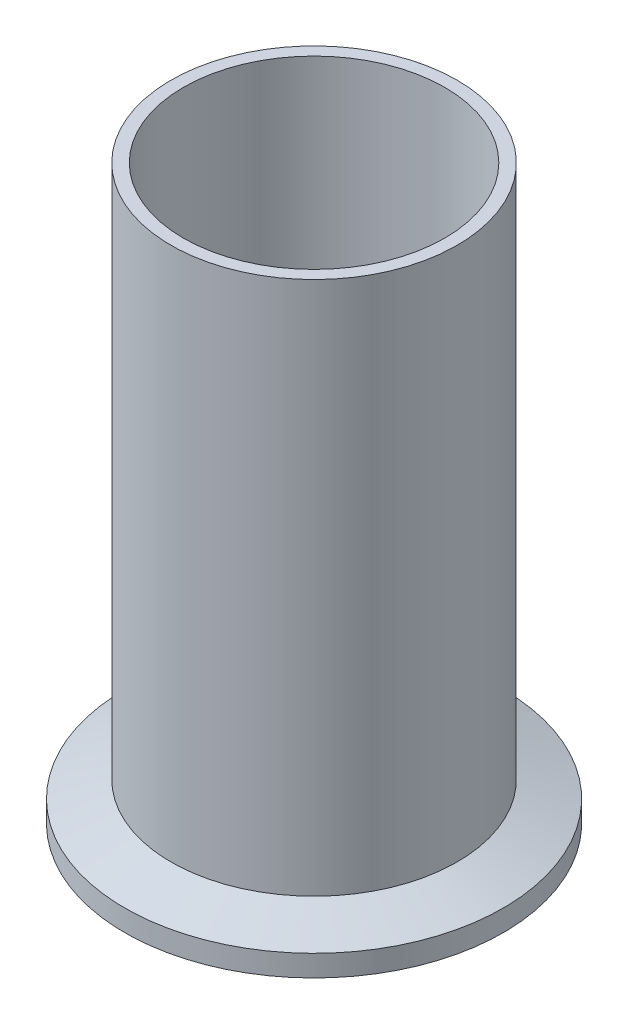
from build123d import *


with BuildPart() as part:
    # Sketch1 → Revolve2 (revolve)
    with BuildSketch(Plane.XY, mode=Mode.PRIVATE) as revolve2_sk:
        with BuildLine():
            Line((-17.399, 0), (-17.399, 76.2))
            Line((-17.399, 76.2), (-19.05, 76.2))
            Line((-19.05, 76.2), (-19.05, 5.082052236))
            Line((-19.05, 5.082052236), (-25.1968, 2.8448))
            Line((-25.1968, 2.8448), (-25.1968, 0))
            Line((-25.1968, 0), (-23.636608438, 0))
            ThreePointArc((-23.636608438, 0), (-23.204411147, 0.129217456), (-22.914066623, 0.474458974))
            ThreePointArc((-22.914066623, 0.474458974), (-21.8186, 1.1938), (-20.723133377, 0.474458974))
            ThreePointArc((-20.723133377, 0.474458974), (-20.432788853, 0.129217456), (-20.000591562, 0))
            Line((-20.000591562, 0), (-17.399, 0))
        make_face()
    revolve(revolve2_sk.sketch.rotate(Axis((0, 0, 0), (0, 1, 0)), 270), axis=Axis((0, 0, 0), (0, 1, 0)))


solid = part.part
